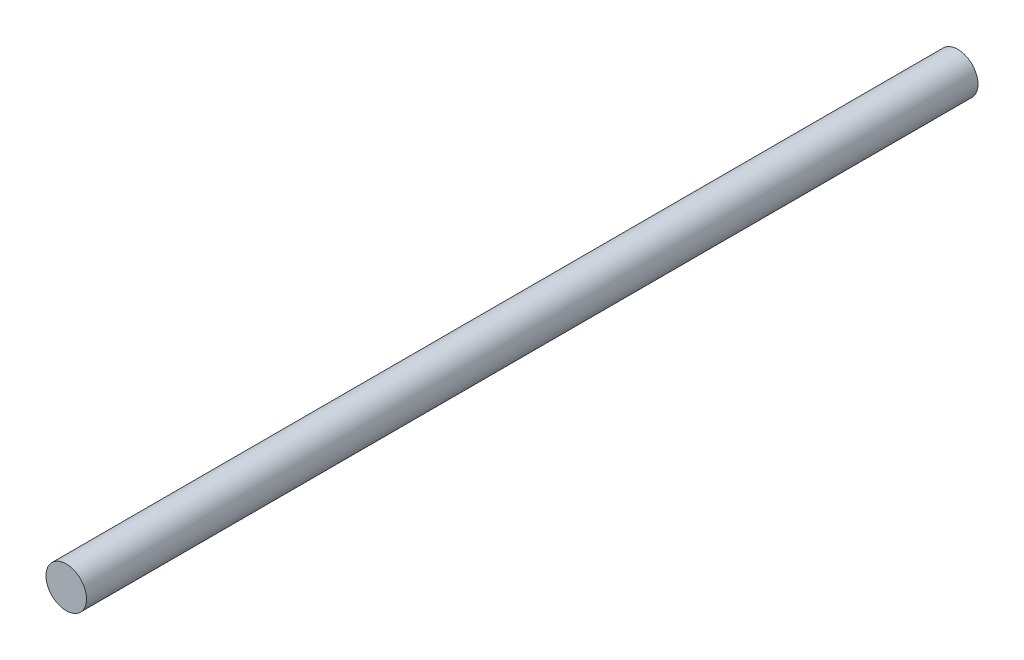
from build123d import *

# Parameters (mm, degrees)
SKETCH1_R           = 3.175
BOSS_EXTRUDE1_DEPTH = 69.85


with BuildPart() as part:
    # Sketch1 → Boss-Extrude1 (new, symmetric)
    with BuildSketch(Plane.XY):
        Circle(SKETCH1_R)
    extrude(amount=BOSS_EXTRUDE1_DEPTH, both=True)


solid = part.part
